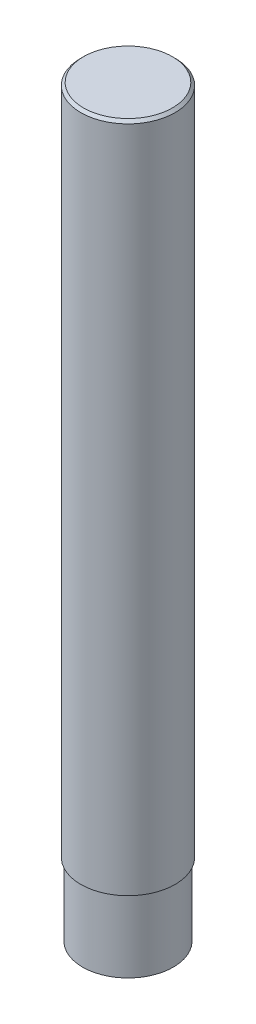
ISO-10303-21;
HEADER;
FILE_DESCRIPTION(('STEP AP214'),'2;1');
FILE_NAME('part.step','',(''),(''),'','','');
FILE_SCHEMA(('AUTOMOTIVE_DESIGN { 1 0 10303 214 1 1 1 1 }'));
ENDSEC;
DATA;
#1=APPLICATION_CONTEXT('core data for automotive mechanical design processes');
#2=APPLICATION_PROTOCOL_DEFINITION('international standard','automotive_design',2000,#1);
#3=PRODUCT_CONTEXT('',#1,'mechanical');
#4=PRODUCT('Part','Part','',(#3));
#5=PRODUCT_RELATED_PRODUCT_CATEGORY('part','',(#4));
#6=PRODUCT_DEFINITION_FORMATION('','',#4);
#7=PRODUCT_DEFINITION_CONTEXT('part definition',#1,'design');
#8=PRODUCT_DEFINITION('design','',#6,#7);
#9=PRODUCT_DEFINITION_SHAPE('','',#8);
#10=(LENGTH_UNIT() NAMED_UNIT(*) SI_UNIT(.MILLI.,.METRE.));
#11=(NAMED_UNIT(*) PLANE_ANGLE_UNIT() SI_UNIT($,.RADIAN.));
#12=(NAMED_UNIT(*) SI_UNIT($,.STERADIAN.) SOLID_ANGLE_UNIT());
#13=UNCERTAINTY_MEASURE_WITH_UNIT(LENGTH_MEASURE(1.E-05),#10,'distance_accuracy_value','');
#14=(GEOMETRIC_REPRESENTATION_CONTEXT(3) GLOBAL_UNCERTAINTY_ASSIGNED_CONTEXT((#13)) GLOBAL_UNIT_ASSIGNED_CONTEXT((#10,
#11,#12)) REPRESENTATION_CONTEXT('',''));
#15=CARTESIAN_POINT('',(0.,0.,0.));
#16=DIRECTION('',(0.,0.,1.));
#17=DIRECTION('',(1.,0.,0.));
#18=AXIS2_PLACEMENT_3D('',#15,#16,#17);
#19=CARTESIAN_POINT('',(0.,0.,-5.2));
#20=DIRECTION('',(0.,1.,0.));
#21=DIRECTION('',(0.,0.,1.));
#22=AXIS2_PLACEMENT_3D('',#19,#20,#21);
#23=PLANE('',#22);
#24=CARTESIAN_POINT('',(0.,0.,0.));
#25=DIRECTION('',(0.,1.,0.));
#26=DIRECTION('',(0.,0.,1.));
#27=AXIS2_PLACEMENT_3D('',#24,#25,#26);
#28=CIRCLE('',#27,5.2);
#29=CARTESIAN_POINT('',(0.,0.,5.2));
#30=VERTEX_POINT('',#29);
#31=EDGE_CURVE('E10',#30,#30,#28,.T.);
#32=ORIENTED_EDGE('',*,*,#31,.F.);
#33=EDGE_LOOP('',(#32));
#34=FACE_BOUND('',#33,.T.);
#35=CARTESIAN_POINT('',(0.,0.,0.));
#36=DIRECTION('',(0.,1.,0.));
#37=DIRECTION('',(0.,0.,1.));
#38=AXIS2_PLACEMENT_3D('',#35,#36,#37);
#39=CIRCLE('',#38,5.00000000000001);
#40=CARTESIAN_POINT('',(0.,0.,5.00000000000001));
#41=VERTEX_POINT('',#40);
#42=EDGE_CURVE('E50',#41,#41,#39,.T.);
#43=ORIENTED_EDGE('',*,*,#42,.T.);
#44=EDGE_LOOP('',(#43));
#45=FACE_BOUND('',#44,.T.);
#46=ADVANCED_FACE('F31',(#34,#45),#23,.F.);
#47=CARTESIAN_POINT('',(0.,41.0769679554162,0.));
#48=DIRECTION('',(0.,1.,0.));
#49=DIRECTION('',(0.,0.,1.));
#50=AXIS2_PLACEMENT_3D('',#47,#48,#49);
#51=CYLINDRICAL_SURFACE('',#50,5.19999999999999);
#52=CARTESIAN_POINT('',(0.,73.7,0.));
#53=DIRECTION('',(0.,1.,0.));
#54=DIRECTION('',(0.,0.,1.));
#55=AXIS2_PLACEMENT_3D('',#52,#53,#54);
#56=CIRCLE('',#55,5.19999999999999);
#57=CARTESIAN_POINT('',(0.,73.7,5.19999999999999));
#58=VERTEX_POINT('',#57);
#59=EDGE_CURVE('E37',#58,#58,#56,.T.);
#60=ORIENTED_EDGE('',*,*,#59,.F.);
#61=EDGE_LOOP('',(#60));
#62=FACE_BOUND('',#61,.T.);
#63=ORIENTED_EDGE('',*,*,#31,.T.);
#64=EDGE_LOOP('',(#63));
#65=FACE_BOUND('',#64,.T.);
#66=ADVANCED_FACE('F72',(#62,#65),#51,.T.);
#67=CARTESIAN_POINT('',(0.,73.7,0.));
#68=DIRECTION('',(0.,-1.,0.));
#69=DIRECTION('',(0.,0.,-1.));
#70=AXIS2_PLACEMENT_3D('',#67,#68,#69);
#71=CONICAL_SURFACE('',#70,5.19999999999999,0.785398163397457);
#72=CARTESIAN_POINT('',(0.,74.,0.));
#73=DIRECTION('',(0.,1.,0.));
#74=DIRECTION('',(0.,0.,1.));
#75=AXIS2_PLACEMENT_3D('',#72,#73,#74);
#76=CIRCLE('',#75,4.89999999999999);
#77=CARTESIAN_POINT('',(0.,74.,4.89999999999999));
#78=VERTEX_POINT('',#77);
#79=EDGE_CURVE('E41',#78,#78,#76,.T.);
#80=ORIENTED_EDGE('',*,*,#79,.F.);
#81=EDGE_LOOP('',(#80));
#82=FACE_BOUND('',#81,.T.);
#83=ORIENTED_EDGE('',*,*,#59,.T.);
#84=EDGE_LOOP('',(#83));
#85=FACE_BOUND('',#84,.T.);
#86=ADVANCED_FACE('F68',(#82,#85),#71,.T.);
#87=CARTESIAN_POINT('',(0.,74.,0.));
#88=DIRECTION('',(0.,-1.,0.));
#89=DIRECTION('',(0.,0.,-1.));
#90=AXIS2_PLACEMENT_3D('',#87,#88,#89);
#91=PLANE('',#90);
#92=ORIENTED_EDGE('',*,*,#79,.T.);
#93=EDGE_LOOP('',(#92));
#94=FACE_BOUND('',#93,.T.);
#95=ADVANCED_FACE('F63',(#94),#91,.F.);
#96=CARTESIAN_POINT('',(0.,-8.,-5.00000000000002));
#97=DIRECTION('',(0.,1.,0.));
#98=DIRECTION('',(0.,0.,1.));
#99=AXIS2_PLACEMENT_3D('',#96,#97,#98);
#100=PLANE('',#99);
#101=CARTESIAN_POINT('',(0.,-8.,0.));
#102=DIRECTION('',(0.,1.,0.));
#103=DIRECTION('',(0.,0.,1.));
#104=AXIS2_PLACEMENT_3D('',#101,#102,#103);
#105=CIRCLE('',#104,5.00000000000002);
#106=CARTESIAN_POINT('',(0.,-8.,5.00000000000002));
#107=VERTEX_POINT('',#106);
#108=EDGE_CURVE('E45',#107,#107,#105,.T.);
#109=ORIENTED_EDGE('',*,*,#108,.F.);
#110=EDGE_LOOP('',(#109));
#111=FACE_BOUND('',#110,.T.);
#112=ADVANCED_FACE('F58',(#111),#100,.F.);
#113=CARTESIAN_POINT('',(0.,41.0769679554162,0.));
#114=DIRECTION('',(0.,1.,0.));
#115=DIRECTION('',(0.,0.,1.));
#116=AXIS2_PLACEMENT_3D('',#113,#114,#115);
#117=CYLINDRICAL_SURFACE('',#116,5.00000000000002);
#118=ORIENTED_EDGE('',*,*,#42,.F.);
#119=EDGE_LOOP('',(#118));
#120=FACE_BOUND('',#119,.T.);
#121=ORIENTED_EDGE('',*,*,#108,.T.);
#122=EDGE_LOOP('',(#121));
#123=FACE_BOUND('',#122,.T.);
#124=ADVANCED_FACE('F55',(#120,#123),#117,.T.);
#125=CLOSED_SHELL('',(#46,#66,#86,#95,#112,#124));
#126=MANIFOLD_SOLID_BREP('B2',#125);
#127=ADVANCED_BREP_SHAPE_REPRESENTATION('',(#18,#126),#14);
#128=SHAPE_DEFINITION_REPRESENTATION(#9,#127);
ENDSEC;
END-ISO-10303-21;
